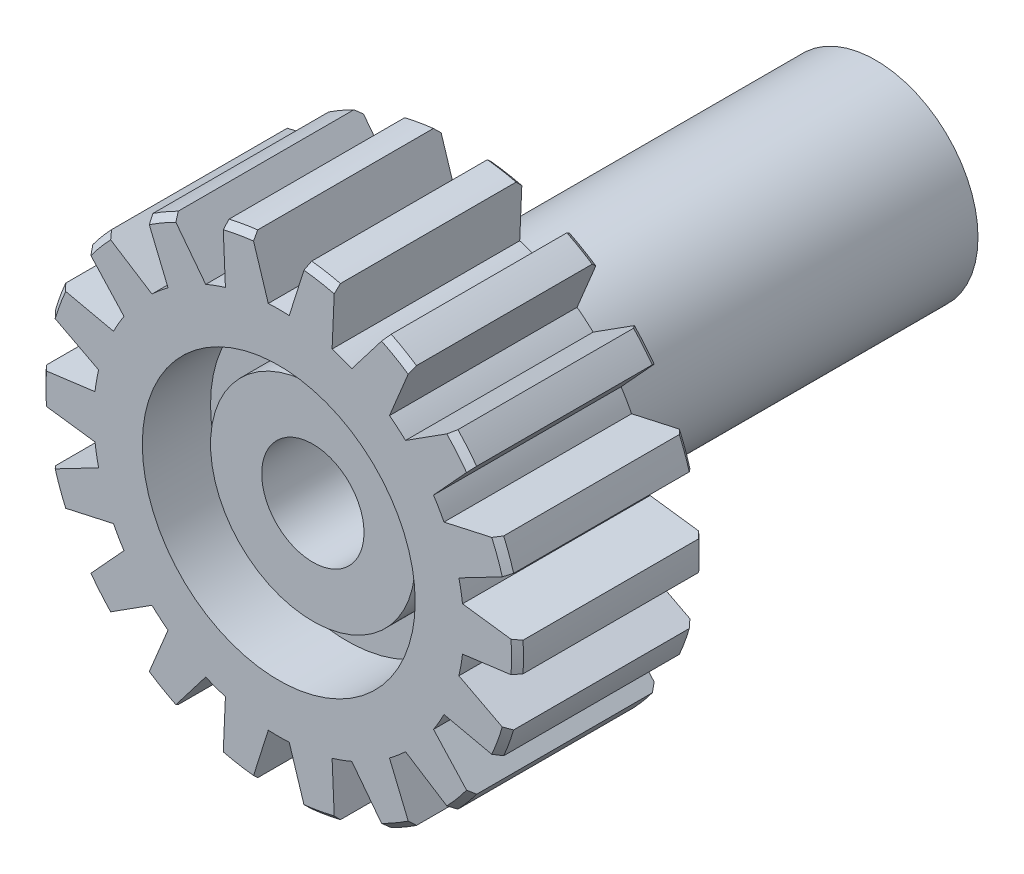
from build123d import *

# Parameters (mm, degrees)
ESQUISSE2_R            = 7
DIAM_TRE_DE_T_TE_DEPTH = 2.75
CHANFREINS_SIZE        = 0.175
CREUX_DENT_DEPTH       = 11.274361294
CREUX_DENT_DEPTH_BACK  = 11.274361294
R_P_TITION_COUNT       = 18
ESQUISSE6_R            = 3
BOSSAGE_ARRI_RE_DEPTH  = 12
ESQUISSE4_R            = 1.5
PASSAGE_AXE_DEPTH      = 5.5
ESQUISSE5_R            = 4
ESQUISSE5_R_2          = 3
GORGE_DEPTH            = 2
ESQUISSE7_R            = 3
RABOTAGE_BOSSAGE_DEPTH = 1
HEXAGONE_DEPTH         = 7


with BuildPart() as part:
    # Esquisse2 → Diam_tre de t_te (new, symmetric)
    with BuildSketch(Plane.XY):
        Circle(ESQUISSE2_R)
    extrude(amount=DIAM_TRE_DE_T_TE_DEPTH, both=True)

    # Chanfreins
    chanfreins_edges = [part.edges().sort_by_distance(p)[0] for p in [
        (-7, 0, -2.75),
        (-7, 0, 2.75),
    ]]
    chamfer(chanfreins_edges, length=CHANFREINS_SIZE)

    # Esquisse3 → Creux dent (cut, two sides: drawn at the far end of the back side and taken through both)
    with BuildSketch(Plane.XY.offset(-CREUX_DENT_DEPTH_BACK)):
        with BuildLine():
            Line((-0.307200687, 5.416295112), (-0.792355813, 6.955010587))
            ThreePointArc((-0.792355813, 6.955010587), (0, 7), (0.792355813, 6.955010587))
            Line((0.792355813, 6.955010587), (0.307200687, 5.416295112))
            ThreePointArc((0.307200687, 5.416295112), (0, 5.425), (-0.307200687, 5.416295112))
        make_face()
    creux_dent = extrude(amount=CREUX_DENT_DEPTH + CREUX_DENT_DEPTH_BACK, mode=Mode.SUBTRACT)

    # R_p_tition: Creux dent ×18 about axis
    r_p_tition_axis = Axis((0, 0, 0), (0, 0, 1))
    for i in range(1, R_P_TITION_COUNT):
        add(creux_dent.rotate(r_p_tition_axis, i * 360 / R_P_TITION_COUNT), mode=Mode.SUBTRACT)

    # Esquisse6 → Bossage arri_re (add)
    with BuildSketch(Plane(origin=(0, 0, -2.75), x_dir=(-1, 0, 0), z_dir=(0, 0, -1))):
        with Locations(Location((0, 0, 0), (0, 0, 180))):
            Circle(ESQUISSE6_R)
    extrude(amount=BOSSAGE_ARRI_RE_DEPTH)

    # Esquisse4 → Passage axe (cut)
    with BuildSketch(Plane.XY.offset(2.75)):
        Circle(ESQUISSE4_R)
    extrude(amount=-PASSAGE_AXE_DEPTH, mode=Mode.SUBTRACT)

    # Esquisse5 → Gorge (cut)
    with BuildSketch(Plane.XY.offset(2.75)):
        Circle(ESQUISSE5_R)
        Circle(ESQUISSE5_R_2, mode=Mode.SUBTRACT)
    extrude(amount=-GORGE_DEPTH, mode=Mode.SUBTRACT)

    # Esquisse7 → Rabotage bossage (cut)
    with BuildSketch(Plane.XY.offset(2.75)):
        Circle(ESQUISSE7_R)
    extrude(amount=-RABOTAGE_BOSSAGE_DEPTH, mode=Mode.SUBTRACT)

    # Esquisse8 → Hexagone (cut)
    with BuildSketch(Plane(origin=(0, 0, -14.75), x_dir=(-1, 0, 0), z_dir=(0, 0, -1))):
        Polygon((1.5, -0.866025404), (1.5, 0.866025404), (0, 1.732050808), (-1.5, 0.866025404), (-1.5, -0.866025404), (0, -1.732050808), align=None)
    extrude(amount=-HEXAGONE_DEPTH, mode=Mode.SUBTRACT)


solid = part.part
